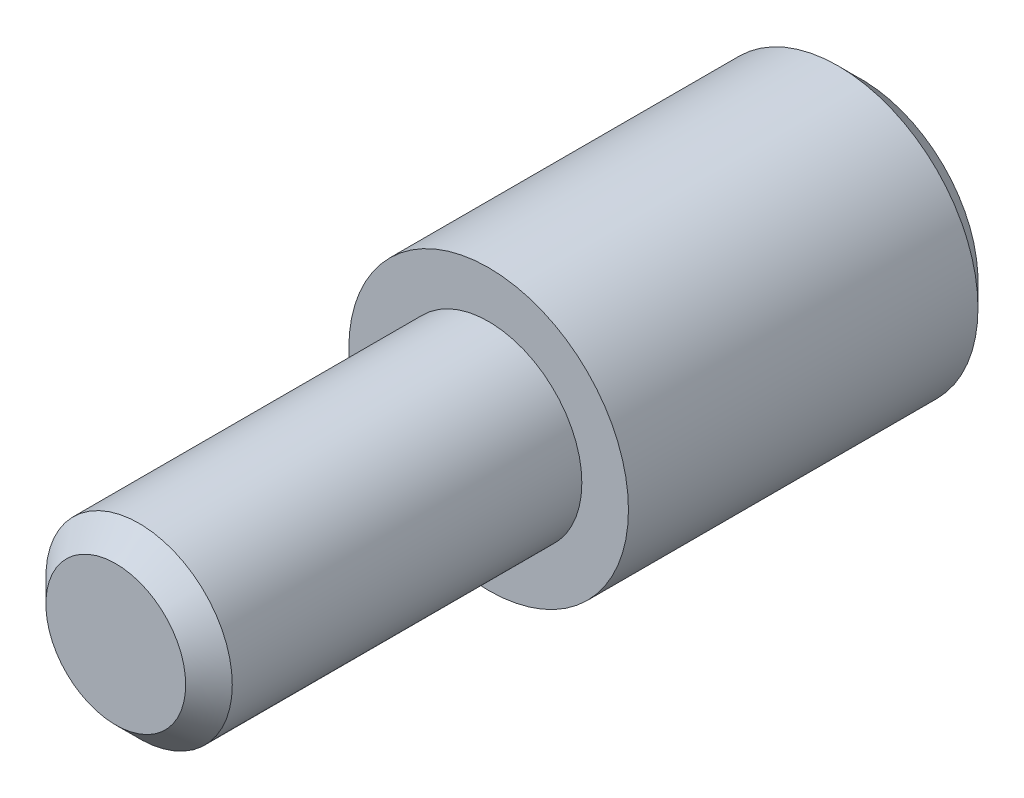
ISO-10303-21;
HEADER;
FILE_DESCRIPTION(('STEP AP214'),'2;1');
FILE_NAME('part.step','',(''),(''),'','','');
FILE_SCHEMA(('AUTOMOTIVE_DESIGN { 1 0 10303 214 1 1 1 1 }'));
ENDSEC;
DATA;
#1=APPLICATION_CONTEXT('core data for automotive mechanical design processes');
#2=APPLICATION_PROTOCOL_DEFINITION('international standard','automotive_design',2000,#1);
#3=PRODUCT_CONTEXT('',#1,'mechanical');
#4=PRODUCT('Part','Part','',(#3));
#5=PRODUCT_RELATED_PRODUCT_CATEGORY('part','',(#4));
#6=PRODUCT_DEFINITION_FORMATION('','',#4);
#7=PRODUCT_DEFINITION_CONTEXT('part definition',#1,'design');
#8=PRODUCT_DEFINITION('design','',#6,#7);
#9=PRODUCT_DEFINITION_SHAPE('','',#8);
#10=(LENGTH_UNIT() NAMED_UNIT(*) SI_UNIT(.MILLI.,.METRE.));
#11=(NAMED_UNIT(*) PLANE_ANGLE_UNIT() SI_UNIT($,.RADIAN.));
#12=(NAMED_UNIT(*) SI_UNIT($,.STERADIAN.) SOLID_ANGLE_UNIT());
#13=UNCERTAINTY_MEASURE_WITH_UNIT(LENGTH_MEASURE(1.E-05),#10,'distance_accuracy_value','');
#14=(GEOMETRIC_REPRESENTATION_CONTEXT(3) GLOBAL_UNCERTAINTY_ASSIGNED_CONTEXT((#13)) GLOBAL_UNIT_ASSIGNED_CONTEXT((#10,
#11,#12)) REPRESENTATION_CONTEXT('',''));
#15=CARTESIAN_POINT('',(0.,0.,0.));
#16=DIRECTION('',(0.,0.,1.));
#17=DIRECTION('',(1.,0.,0.));
#18=AXIS2_PLACEMENT_3D('',#15,#16,#17);
#19=CARTESIAN_POINT('',(0.,0.,0.));
#20=DIRECTION('',(0.,0.,1.));
#21=DIRECTION('',(1.,0.,0.));
#22=AXIS2_PLACEMENT_3D('',#19,#20,#21);
#23=PLANE('',#22);
#24=CARTESIAN_POINT('',(0.,0.,0.));
#25=DIRECTION('',(0.,0.,1.));
#26=DIRECTION('',(1.,0.,0.));
#27=AXIS2_PLACEMENT_3D('',#24,#25,#26);
#28=CIRCLE('',#27,1.5);
#29=CARTESIAN_POINT('',(1.5,0.,0.));
#30=VERTEX_POINT('',#29);
#31=EDGE_CURVE('E44',#30,#30,#28,.T.);
#32=ORIENTED_EDGE('',*,*,#31,.T.);
#33=EDGE_LOOP('',(#32));
#34=FACE_BOUND('',#33,.T.);
#35=ADVANCED_FACE('F30',(#34),#23,.T.);
#36=CARTESIAN_POINT('',(0.,0.,0.));
#37=DIRECTION('',(0.,0.,1.));
#38=DIRECTION('',(1.,0.,0.));
#39=AXIS2_PLACEMENT_3D('',#36,#37,#38);
#40=CYLINDRICAL_SURFACE('',#39,2.);
#41=CARTESIAN_POINT('',(0.,0.,-0.500000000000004));
#42=DIRECTION('',(0.,0.,1.));
#43=DIRECTION('',(1.,0.,0.));
#44=AXIS2_PLACEMENT_3D('',#41,#42,#43);
#45=CIRCLE('',#44,2.);
#46=CARTESIAN_POINT('',(2.,0.,-0.500000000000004));
#47=VERTEX_POINT('',#46);
#48=EDGE_CURVE('E40',#47,#47,#45,.F.);
#49=ORIENTED_EDGE('',*,*,#48,.T.);
#50=EDGE_LOOP('',(#49));
#51=FACE_BOUND('',#50,.T.);
#52=CARTESIAN_POINT('',(0.,0.,-8.));
#53=DIRECTION('',(0.,0.,1.));
#54=DIRECTION('',(1.,0.,0.));
#55=AXIS2_PLACEMENT_3D('',#52,#53,#54);
#56=CIRCLE('',#55,2.);
#57=CARTESIAN_POINT('',(2.,0.,-8.));
#58=VERTEX_POINT('',#57);
#59=EDGE_CURVE('E49',#58,#58,#56,.T.);
#60=ORIENTED_EDGE('',*,*,#59,.T.);
#61=EDGE_LOOP('',(#60));
#62=FACE_BOUND('',#61,.T.);
#63=ADVANCED_FACE('F69',(#51,#62),#40,.T.);
#64=CARTESIAN_POINT('',(2.,0.,-8.));
#65=DIRECTION('',(0.,0.,1.));
#66=DIRECTION('',(1.,0.,0.));
#67=AXIS2_PLACEMENT_3D('',#64,#65,#66);
#68=PLANE('',#67);
#69=CARTESIAN_POINT('',(0.,0.,-8.));
#70=DIRECTION('',(0.,0.,1.));
#71=DIRECTION('',(1.,0.,0.));
#72=AXIS2_PLACEMENT_3D('',#69,#70,#71);
#73=CIRCLE('',#72,3.);
#74=CARTESIAN_POINT('',(3.,0.,-8.));
#75=VERTEX_POINT('',#74);
#76=EDGE_CURVE('E52',#75,#75,#73,.T.);
#77=ORIENTED_EDGE('',*,*,#76,.T.);
#78=EDGE_LOOP('',(#77));
#79=FACE_BOUND('',#78,.T.);
#80=ORIENTED_EDGE('',*,*,#59,.F.);
#81=EDGE_LOOP('',(#80));
#82=FACE_BOUND('',#81,.T.);
#83=ADVANCED_FACE('F56',(#79,#82),#68,.T.);
#84=CARTESIAN_POINT('',(0.,0.,0.));
#85=DIRECTION('',(0.,0.,1.));
#86=DIRECTION('',(1.,0.,0.));
#87=AXIS2_PLACEMENT_3D('',#84,#85,#86);
#88=CYLINDRICAL_SURFACE('',#87,3.);
#89=CARTESIAN_POINT('',(0.,0.,-15.5));
#90=DIRECTION('',(0.,0.,-1.));
#91=DIRECTION('',(-1.,0.,0.));
#92=AXIS2_PLACEMENT_3D('',#89,#90,#91);
#93=CIRCLE('',#92,3.);
#94=CARTESIAN_POINT('',(-3.,0.,-15.5));
#95=VERTEX_POINT('',#94);
#96=EDGE_CURVE('E36',#95,#95,#93,.F.);
#97=ORIENTED_EDGE('',*,*,#96,.T.);
#98=EDGE_LOOP('',(#97));
#99=FACE_BOUND('',#98,.T.);
#100=ORIENTED_EDGE('',*,*,#76,.F.);
#101=EDGE_LOOP('',(#100));
#102=FACE_BOUND('',#101,.T.);
#103=ADVANCED_FACE('F59',(#99,#102),#88,.T.);
#104=CARTESIAN_POINT('',(3.,0.,-16.));
#105=DIRECTION('',(0.,0.,-1.));
#106=DIRECTION('',(-1.,0.,0.));
#107=AXIS2_PLACEMENT_3D('',#104,#105,#106);
#108=PLANE('',#107);
#109=CARTESIAN_POINT('',(0.,0.,-16.));
#110=DIRECTION('',(0.,0.,-1.));
#111=DIRECTION('',(-1.,0.,0.));
#112=AXIS2_PLACEMENT_3D('',#109,#110,#111);
#113=CIRCLE('',#112,2.5);
#114=CARTESIAN_POINT('',(-2.5,0.,-16.));
#115=VERTEX_POINT('',#114);
#116=EDGE_CURVE('E10',#115,#115,#113,.T.);
#117=ORIENTED_EDGE('',*,*,#116,.T.);
#118=EDGE_LOOP('',(#117));
#119=FACE_BOUND('',#118,.T.);
#120=ADVANCED_FACE('F61',(#119),#108,.T.);
#121=CARTESIAN_POINT('',(0.,0.,0.));
#122=DIRECTION('',(0.,0.,-1.));
#123=DIRECTION('',(-1.,0.,0.));
#124=AXIS2_PLACEMENT_3D('',#121,#122,#123);
#125=CONICAL_SURFACE('',#124,1.5,0.785398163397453);
#126=ORIENTED_EDGE('',*,*,#48,.F.);
#127=EDGE_LOOP('',(#126));
#128=FACE_BOUND('',#127,.T.);
#129=ORIENTED_EDGE('',*,*,#31,.F.);
#130=EDGE_LOOP('',(#129));
#131=FACE_BOUND('',#130,.T.);
#132=ADVANCED_FACE('F67',(#128,#131),#125,.T.);
#133=CARTESIAN_POINT('',(0.,0.,-15.5));
#134=DIRECTION('',(0.,0.,1.));
#135=DIRECTION('',(1.,0.,0.));
#136=AXIS2_PLACEMENT_3D('',#133,#134,#135);
#137=CONICAL_SURFACE('',#136,3.,0.785398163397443);
#138=ORIENTED_EDGE('',*,*,#116,.F.);
#139=EDGE_LOOP('',(#138));
#140=FACE_BOUND('',#139,.T.);
#141=ORIENTED_EDGE('',*,*,#96,.F.);
#142=EDGE_LOOP('',(#141));
#143=FACE_BOUND('',#142,.T.);
#144=ADVANCED_FACE('F80',(#140,#143),#137,.T.);
#145=CLOSED_SHELL('',(#35,#63,#83,#103,#120,#132,#144));
#146=MANIFOLD_SOLID_BREP('B2',#145);
#147=ADVANCED_BREP_SHAPE_REPRESENTATION('',(#18,#146),#14);
#148=SHAPE_DEFINITION_REPRESENTATION(#9,#147);
ENDSEC;
END-ISO-10303-21;
